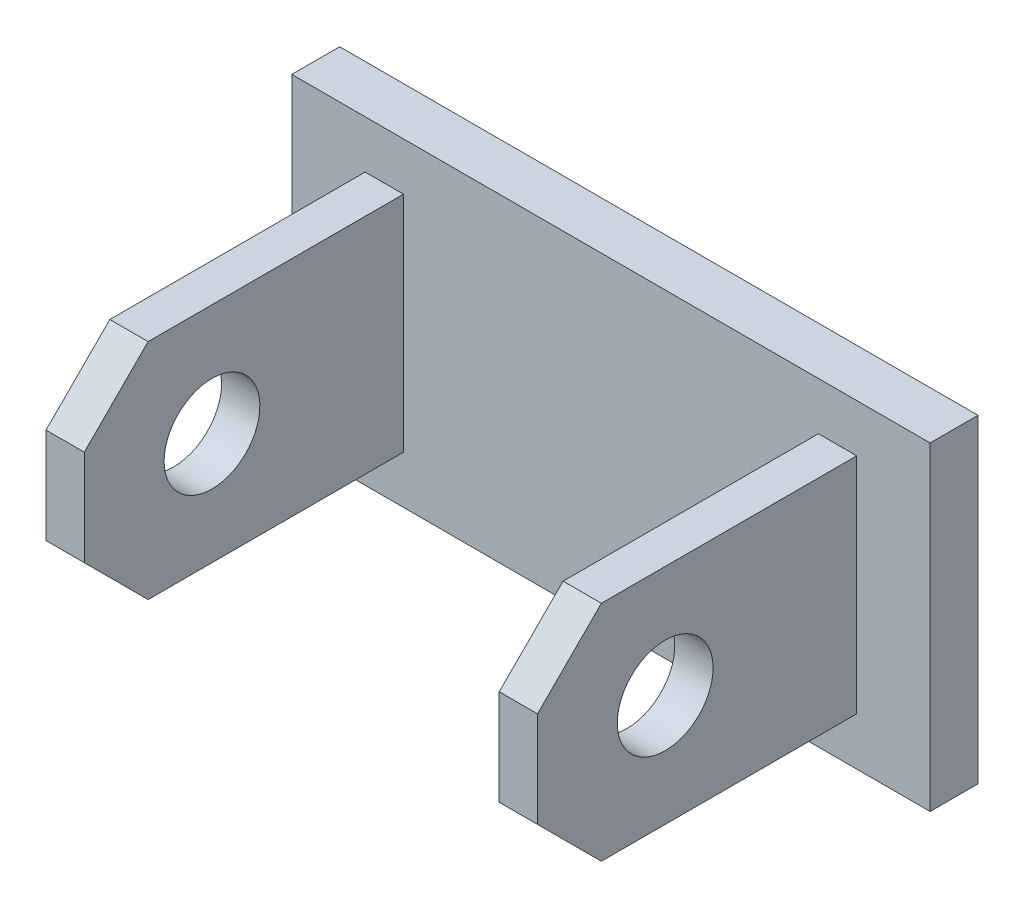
from build123d import *

# Parameters (mm, degrees)
SZKIC1_W                    = 200
SZKIC1_H                    = 100
DODANIE_WYCI_GNI_CIE1_DEPTH = 15
SZKIC2_W                    = 12
SZKIC2_H                    = 70
DODANIE_WYCI_GNI_CIE2_DEPTH = 100
SFAZOWANIE1_SIZE            = 20
SZKIC3_R                    = 15
WYTNIJ_WYCI_GNI_CIE1_DEPTH  = 217.919339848


with BuildPart() as part:
    # Szkic1 → Dodanie-wyci_gni_cie1 (new body)
    with BuildSketch(Plane.XY):
        Rectangle(SZKIC1_W, SZKIC1_H)
    extrude(amount=DODANIE_WYCI_GNI_CIE1_DEPTH)


with BuildPart() as body_2:
    # Szkic2 → Dodanie-wyci_gni_cie2 (new body)
    with BuildSketch(Plane.XY.offset(15)):
        with Locations((-71, 0)):
            Rectangle(SZKIC2_W, SZKIC2_H)
    extrude(amount=DODANIE_WYCI_GNI_CIE2_DEPTH)

    # Sfazowanie1
    sfazowanie1_edges = [body_2.edges().sort_by_distance(p)[0] for p in [
        (-71, 35, 115),
        (-71, -35, 115),
    ]]
    chamfer(sfazowanie1_edges, length=SFAZOWANIE1_SIZE)

    # Szkic3 → Wytnij-wyci_gni_cie1 (cut, through all)
    with BuildSketch(Plane.ZY.offset(77)):
        with Locations(Location((75, 0, 0), (0, 0, 270))):
            Circle(SZKIC3_R)
    extrude(amount=-WYTNIJ_WYCI_GNI_CIE1_DEPTH, mode=Mode.SUBTRACT)


with BuildPart() as body_3:
    # Lustro1: mirrored copy
    add(body_2.part.mirror(Plane(origin=(0, 0, 0), x_dir=(0, 0, 1), z_dir=(1, 0, 0))))


solid = Compound([part.part, body_2.part, body_3.part])
